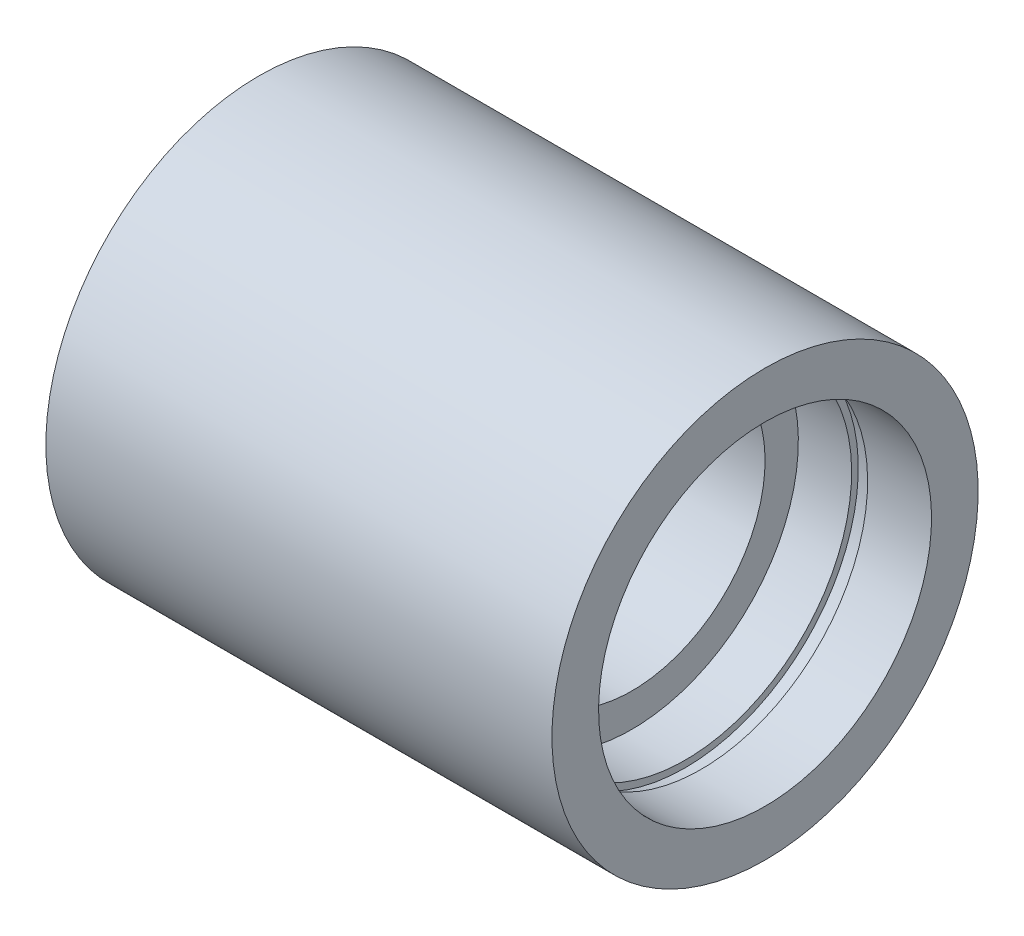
from build123d import *


with BuildPart() as part:
    # Esquisse1 → Base-R_volution (revolve)
    with BuildSketch(Plane.XY):
        Polygon((0, 16), (0, 12.5), (-4.8, 12.5), (-4.8, 13), (-6, 13), (-6, 12.5), (-10, 12.5), (-10, 10), (-24, 10), (-24, 4), (-29, 4), (-29, 12.5), (-38, 12.5), (-38, 16), align=None)
    revolve(axis=Axis((0, 0, 0), (-1, 0, 0)))


solid = part.part
